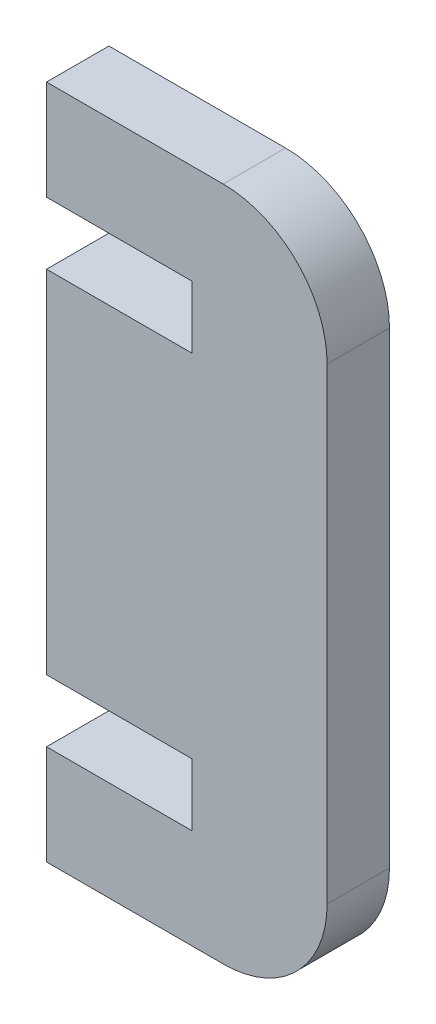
from build123d import *

# Parameters (mm, degrees)
BOSS_EXTRUDE1_DEPTH = 3


with BuildPart() as part:
    # Sketch1 → Boss-Extrude1 (new body)
    with BuildSketch(Plane.XY):
        with BuildLine():
            Line((-6.75, 8.45), (-6.75, -8.45))
            Line((-6.75, -8.45), (0.25, -8.45))
            Line((0.25, -8.45), (0.25, -11.45))
            Line((0.25, -11.45), (-6.75, -11.45))
            Line((-6.75, -11.45), (-6.75, -16.25))
            Line((-6.75, -16.25), (1.75, -16.25))
            ThreePointArc((1.75, -16.25), (5.285533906, -14.785533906), (6.75, -11.25))
            Line((6.75, -11.25), (6.75, 11.25))
            ThreePointArc((6.75, 11.25), (5.285533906, 14.785533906), (1.75, 16.25))
            Line((1.75, 16.25), (-6.75, 16.25))
            Line((-6.75, 16.25), (-6.75, 11.45))
            Line((-6.75, 11.45), (0.25, 11.45))
            Line((0.25, 11.45), (0.25, 8.45))
            Line((0.25, 8.45), (-6.75, 8.45))
        make_face()
    extrude(amount=BOSS_EXTRUDE1_DEPTH)


solid = part.part
